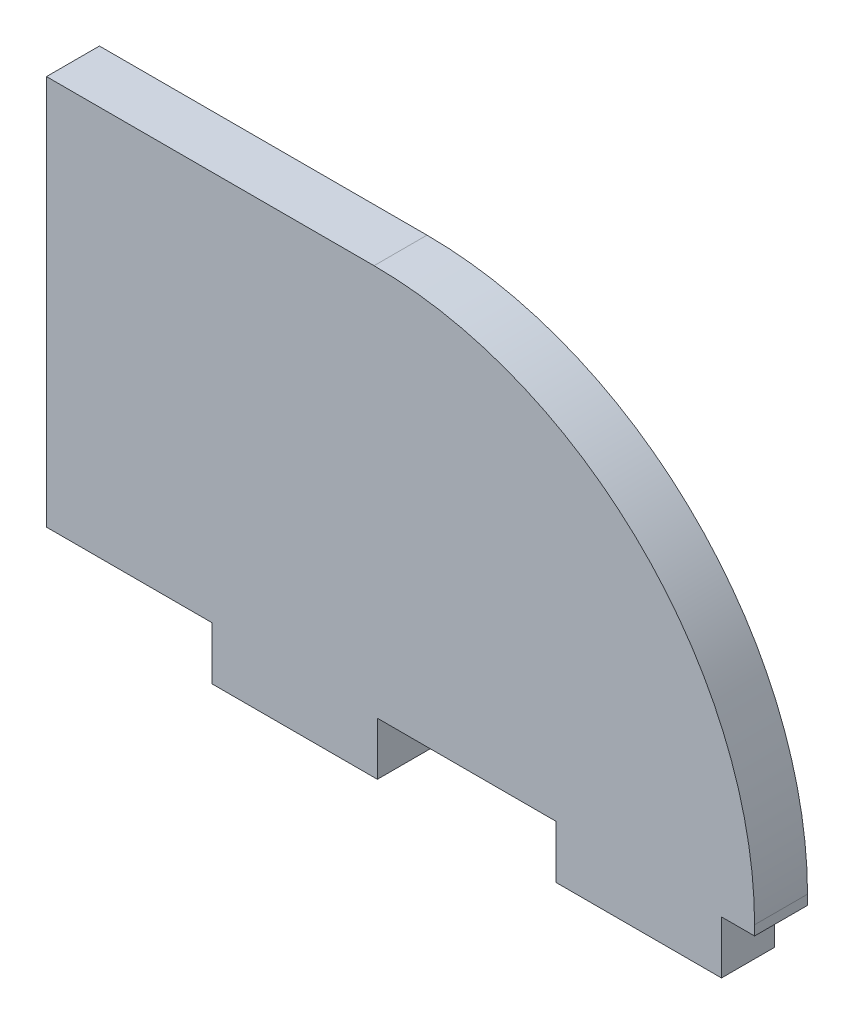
from build123d import *

# Parameters (mm, degrees)
BOSS_EXTRUDE1_DEPTH = 16
FILLET1_R           = 115


with BuildPart() as part:
    # Sketch1 → Boss-Extrude1 (new body)
    with BuildSketch(Plane.XY):
        Polygon((50, 16), (50, 0), (100, 0), (100, 16), (154, 16), (154, 0), (204, 0), (204, 16), (214, 16), (214, 133.933002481), (0, 133.933002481), (0, 16), align=None)
    extrude(amount=BOSS_EXTRUDE1_DEPTH)

    # Fillet1
    fillet1_edges = [part.edges().sort_by_distance(p)[0] for p in [
        (214, 133.933002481, 8),
    ]]
    fillet(fillet1_edges, radius=FILLET1_R)


solid = part.part
